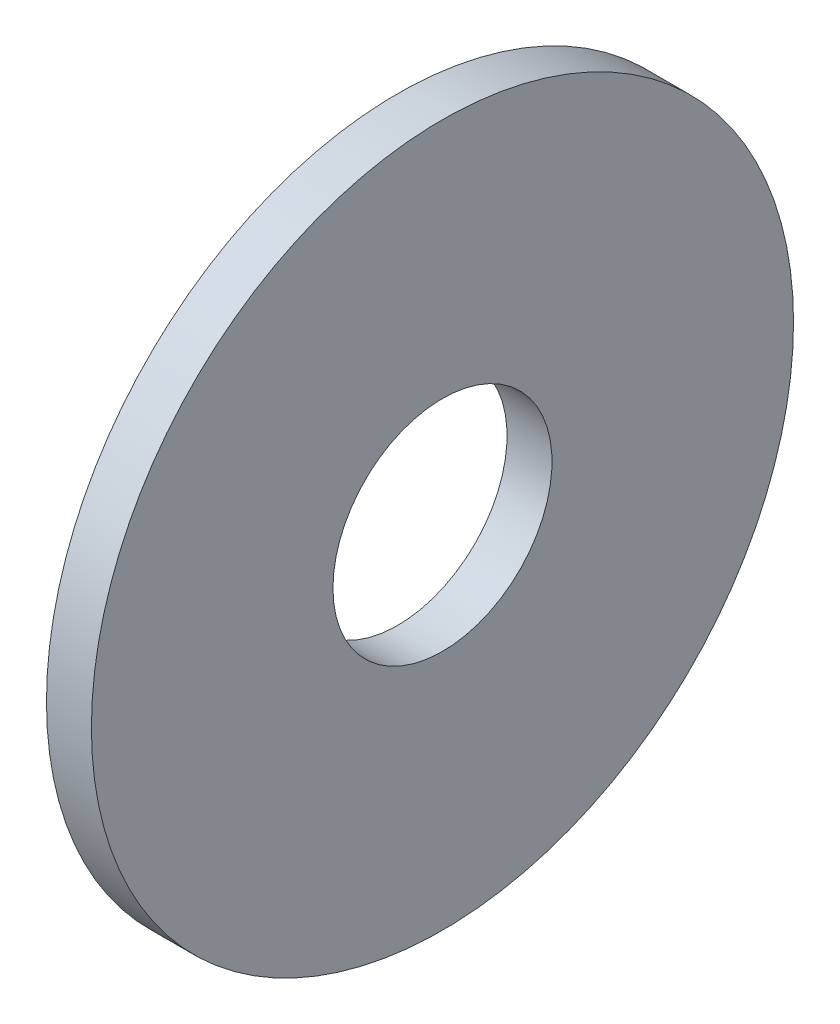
ISO-10303-21;
HEADER;
FILE_DESCRIPTION(('STEP AP214'),'2;1');
FILE_NAME('part.step','',(''),(''),'','','');
FILE_SCHEMA(('AUTOMOTIVE_DESIGN { 1 0 10303 214 1 1 1 1 }'));
ENDSEC;
DATA;
#1=APPLICATION_CONTEXT('core data for automotive mechanical design processes');
#2=APPLICATION_PROTOCOL_DEFINITION('international standard','automotive_design',2000,#1);
#3=PRODUCT_CONTEXT('',#1,'mechanical');
#4=PRODUCT('Part','Part','',(#3));
#5=PRODUCT_RELATED_PRODUCT_CATEGORY('part','',(#4));
#6=PRODUCT_DEFINITION_FORMATION('','',#4);
#7=PRODUCT_DEFINITION_CONTEXT('part definition',#1,'design');
#8=PRODUCT_DEFINITION('design','',#6,#7);
#9=PRODUCT_DEFINITION_SHAPE('','',#8);
#10=(LENGTH_UNIT() NAMED_UNIT(*) SI_UNIT(.MILLI.,.METRE.));
#11=(NAMED_UNIT(*) PLANE_ANGLE_UNIT() SI_UNIT($,.RADIAN.));
#12=(NAMED_UNIT(*) SI_UNIT($,.STERADIAN.) SOLID_ANGLE_UNIT());
#13=UNCERTAINTY_MEASURE_WITH_UNIT(LENGTH_MEASURE(1.E-05),#10,'distance_accuracy_value','');
#14=(GEOMETRIC_REPRESENTATION_CONTEXT(3) GLOBAL_UNCERTAINTY_ASSIGNED_CONTEXT((#13)) GLOBAL_UNIT_ASSIGNED_CONTEXT((#10,
#11,#12)) REPRESENTATION_CONTEXT('',''));
#15=CARTESIAN_POINT('',(0.,0.,0.));
#16=DIRECTION('',(0.,0.,1.));
#17=DIRECTION('',(1.,0.,0.));
#18=AXIS2_PLACEMENT_3D('',#15,#16,#17);
#19=CARTESIAN_POINT('',(-34.9249999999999,0.,0.));
#20=DIRECTION('',(-1.,0.,0.));
#21=DIRECTION('',(0.,0.,1.));
#22=AXIS2_PLACEMENT_3D('',#19,#20,#21);
#23=CYLINDRICAL_SURFACE('',#22,19.5);
#24=CARTESIAN_POINT('',(0.,0.,0.));
#25=DIRECTION('',(-1.,0.,0.));
#26=DIRECTION('',(0.,0.,1.));
#27=AXIS2_PLACEMENT_3D('',#24,#25,#26);
#28=CIRCLE('',#27,19.5);
#29=CARTESIAN_POINT('',(0.,0.,19.5));
#30=VERTEX_POINT('',#29);
#31=EDGE_CURVE('E10',#30,#30,#28,.T.);
#32=ORIENTED_EDGE('',*,*,#31,.F.);
#33=EDGE_LOOP('',(#32));
#34=FACE_BOUND('',#33,.T.);
#35=CARTESIAN_POINT('',(-8.,0.,0.));
#36=DIRECTION('',(-1.,0.,0.));
#37=DIRECTION('',(0.,0.,1.));
#38=AXIS2_PLACEMENT_3D('',#35,#36,#37);
#39=CIRCLE('',#38,19.5);
#40=CARTESIAN_POINT('',(-8.,0.,19.5));
#41=VERTEX_POINT('',#40);
#42=EDGE_CURVE('E45',#41,#41,#39,.T.);
#43=ORIENTED_EDGE('',*,*,#42,.T.);
#44=EDGE_LOOP('',(#43));
#45=FACE_BOUND('',#44,.T.);
#46=ADVANCED_FACE('F31',(#34,#45),#23,.F.);
#47=CARTESIAN_POINT('',(0.,19.5,0.));
#48=DIRECTION('',(-1.,0.,0.));
#49=DIRECTION('',(0.,0.,1.));
#50=AXIS2_PLACEMENT_3D('',#47,#48,#49);
#51=PLANE('',#50);
#52=CARTESIAN_POINT('',(0.,0.,0.));
#53=DIRECTION('',(-1.,0.,0.));
#54=DIRECTION('',(0.,0.,1.));
#55=AXIS2_PLACEMENT_3D('',#52,#53,#54);
#56=CIRCLE('',#55,62.5);
#57=CARTESIAN_POINT('',(0.,0.,62.5));
#58=VERTEX_POINT('',#57);
#59=EDGE_CURVE('E37',#58,#58,#56,.T.);
#60=ORIENTED_EDGE('',*,*,#59,.F.);
#61=EDGE_LOOP('',(#60));
#62=FACE_BOUND('',#61,.T.);
#63=ORIENTED_EDGE('',*,*,#31,.T.);
#64=EDGE_LOOP('',(#63));
#65=FACE_BOUND('',#64,.T.);
#66=ADVANCED_FACE('F60',(#62,#65),#51,.F.);
#67=CARTESIAN_POINT('',(-34.9249999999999,0.,0.));
#68=DIRECTION('',(-1.,0.,0.));
#69=DIRECTION('',(0.,0.,1.));
#70=AXIS2_PLACEMENT_3D('',#67,#68,#69);
#71=CYLINDRICAL_SURFACE('',#70,62.5);
#72=CARTESIAN_POINT('',(-8.,0.,0.));
#73=DIRECTION('',(-1.,0.,0.));
#74=DIRECTION('',(0.,0.,1.));
#75=AXIS2_PLACEMENT_3D('',#72,#73,#74);
#76=CIRCLE('',#75,62.5);
#77=CARTESIAN_POINT('',(-8.,0.,62.5));
#78=VERTEX_POINT('',#77);
#79=EDGE_CURVE('E41',#78,#78,#76,.T.);
#80=ORIENTED_EDGE('',*,*,#79,.F.);
#81=EDGE_LOOP('',(#80));
#82=FACE_BOUND('',#81,.T.);
#83=ORIENTED_EDGE('',*,*,#59,.T.);
#84=EDGE_LOOP('',(#83));
#85=FACE_BOUND('',#84,.T.);
#86=ADVANCED_FACE('F55',(#82,#85),#71,.T.);
#87=CARTESIAN_POINT('',(-8.,62.5,0.));
#88=DIRECTION('',(1.,0.,0.));
#89=DIRECTION('',(0.,0.,-1.));
#90=AXIS2_PLACEMENT_3D('',#87,#88,#89);
#91=PLANE('',#90);
#92=ORIENTED_EDGE('',*,*,#42,.F.);
#93=EDGE_LOOP('',(#92));
#94=FACE_BOUND('',#93,.T.);
#95=ORIENTED_EDGE('',*,*,#79,.T.);
#96=EDGE_LOOP('',(#95));
#97=FACE_BOUND('',#96,.T.);
#98=ADVANCED_FACE('F52',(#94,#97),#91,.F.);
#99=CLOSED_SHELL('',(#46,#66,#86,#98));
#100=MANIFOLD_SOLID_BREP('B2',#99);
#101=ADVANCED_BREP_SHAPE_REPRESENTATION('',(#18,#100),#14);
#102=SHAPE_DEFINITION_REPRESENTATION(#9,#101);
ENDSEC;
END-ISO-10303-21;
